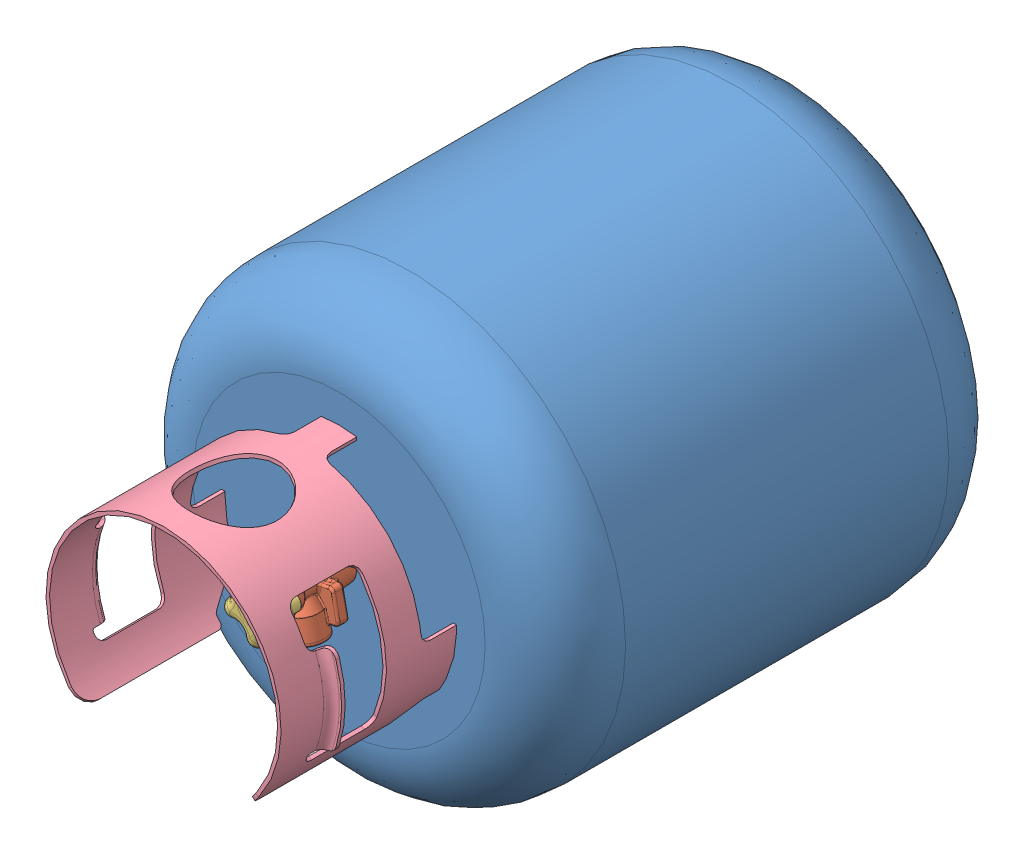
SolidWorks assembly Propane Tank Assembly.SLDASM, configuration Default (file format 10000). Lengths in mm.
Overall size (313.18 313.18 462.54).
5 component instances, 4 part files, 4 mates.
Components (placement in the parent):
- Tank Body-1: Tank Body.SLDPRT [Default] at origin size (313.18 313.18 335.53)
- Propane Valve Assembly-1: Propane Valve Assembly.SLDASM [Default] at (0 0 -11.0991) x (0.198748 -0.980051 0) z (-0.980051 -0.198748 0) size (59.33 63.7 60.99)
  - Valve Body-1: Valve Body.SLDPRT [Default] at (0 346.6331 0) x (-1 0 0) z (0 0 -1) size (49.7 61.89 38.1)
  - Knob, Gas Valve-1: Knob, Gas Valve.SLDPRT [Default] at (0 409.9731 0) x (-0.96497 0 0.262361) z (0 -1 0) size (45.62 50.8 13.06)
- Valve Guard-1: Valve Guard.SLDPRT [Default] at (0 0 411.734) x (0 -1 0) z (0 0 -1) size (145.26 185 127)
Mates (geometry in assembly coordinates):
- Concentric1: concentric anti-aligned: circle of Tank Body-1; cylinder of Propane Valve Assembly-1/Valve Body-1 through (0 0 352.044) axis (0 0 -1) radius 10.2391
- Coincident1: coincident anti-aligned: plane of Tank Body-1 through (0 0 335.534) normal (0 0 1); plane of Propane Valve Assembly-1/Valve Body-1 through (0 0 335.534) normal (0 0 -1)
- Concentric2: concentric aligned: cylinder of Valve Guard-1 through (0 0 879.8601) axis (0 0 -1) radius 82.55; cylinder of Tank Body-1 through (0 0 335.534) axis (0 0 -1) radius 156.591
- Coincident7: coincident anti-aligned: plane of Valve Guard-1; plane of assembly through (0 0 0) normal (1 0 0)
